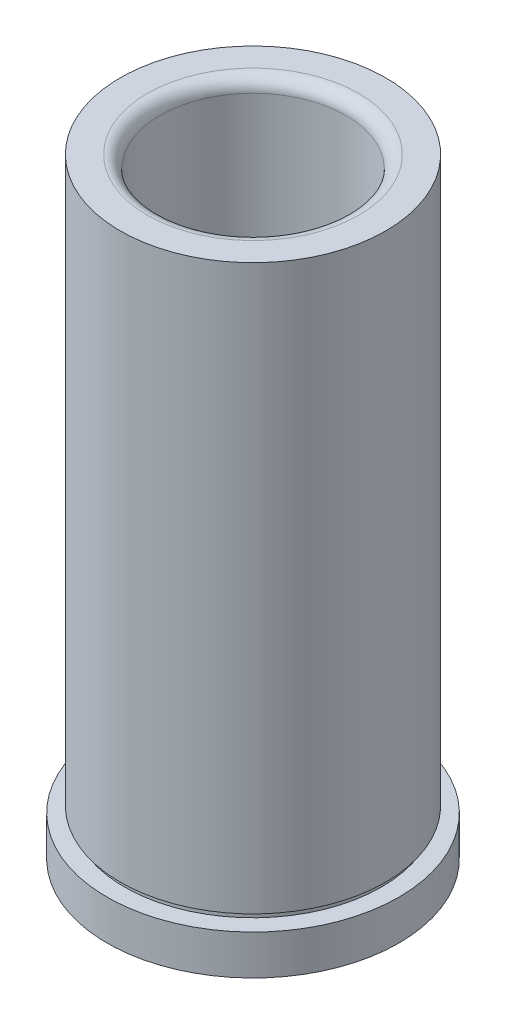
ISO-10303-21;
HEADER;
FILE_DESCRIPTION(('STEP AP214'),'2;1');
FILE_NAME('part.step','',(''),(''),'','','');
FILE_SCHEMA(('AUTOMOTIVE_DESIGN { 1 0 10303 214 1 1 1 1 }'));
ENDSEC;
DATA;
#1=APPLICATION_CONTEXT('core data for automotive mechanical design processes');
#2=APPLICATION_PROTOCOL_DEFINITION('international standard','automotive_design',2000,#1);
#3=PRODUCT_CONTEXT('',#1,'mechanical');
#4=PRODUCT('Part','Part','',(#3));
#5=PRODUCT_RELATED_PRODUCT_CATEGORY('part','',(#4));
#6=PRODUCT_DEFINITION_FORMATION('','',#4);
#7=PRODUCT_DEFINITION_CONTEXT('part definition',#1,'design');
#8=PRODUCT_DEFINITION('design','',#6,#7);
#9=PRODUCT_DEFINITION_SHAPE('','',#8);
#10=(LENGTH_UNIT() NAMED_UNIT(*) SI_UNIT(.MILLI.,.METRE.));
#11=(NAMED_UNIT(*) PLANE_ANGLE_UNIT() SI_UNIT($,.RADIAN.));
#12=(NAMED_UNIT(*) SI_UNIT($,.STERADIAN.) SOLID_ANGLE_UNIT());
#13=UNCERTAINTY_MEASURE_WITH_UNIT(LENGTH_MEASURE(1.E-05),#10,'distance_accuracy_value','');
#14=(GEOMETRIC_REPRESENTATION_CONTEXT(3) GLOBAL_UNCERTAINTY_ASSIGNED_CONTEXT((#13)) GLOBAL_UNIT_ASSIGNED_CONTEXT((#10,
#11,#12)) REPRESENTATION_CONTEXT('',''));
#15=CARTESIAN_POINT('',(0.,0.,0.));
#16=DIRECTION('',(0.,0.,1.));
#17=DIRECTION('',(1.,0.,0.));
#18=AXIS2_PLACEMENT_3D('',#15,#16,#17);
#19=CARTESIAN_POINT('',(-15.88135,73.0249999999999,0.));
#20=DIRECTION('',(0.,-1.,0.));
#21=DIRECTION('',(1.,0.,0.));
#22=AXIS2_PLACEMENT_3D('',#19,#20,#21);
#23=PLANE('',#22);
#24=CARTESIAN_POINT('',(-2.54965572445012E-13,73.025,0.));
#25=DIRECTION('',(0.,-1.,0.));
#26=DIRECTION('',(1.,0.,0.));
#27=AXIS2_PLACEMENT_3D('',#24,#25,#26);
#28=CIRCLE('',#27,12.6428499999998);
#29=CARTESIAN_POINT('',(12.6428499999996,73.025,0.));
#30=VERTEX_POINT('',#29);
#31=EDGE_CURVE('E36',#30,#30,#28,.T.);
#32=ORIENTED_EDGE('',*,*,#31,.T.);
#33=EDGE_LOOP('',(#32));
#34=FACE_BOUND('',#33,.T.);
#35=CARTESIAN_POINT('',(-2.54965572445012E-13,73.0249999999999,0.));
#36=DIRECTION('',(0.,-1.,0.));
#37=DIRECTION('',(1.,0.,0.));
#38=AXIS2_PLACEMENT_3D('',#35,#36,#37);
#39=CIRCLE('',#38,15.8813499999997);
#40=CARTESIAN_POINT('',(15.8813499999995,73.0249999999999,0.));
#41=VERTEX_POINT('',#40);
#42=EDGE_CURVE('E40',#41,#41,#39,.T.);
#43=ORIENTED_EDGE('',*,*,#42,.F.);
#44=EDGE_LOOP('',(#43));
#45=FACE_BOUND('',#44,.T.);
#46=ADVANCED_FACE('F29',(#34,#45),#23,.F.);
#47=CARTESIAN_POINT('',(3.49148336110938E-12,-1000.,0.));
#48=DIRECTION('',(0.,-1.,0.));
#49=DIRECTION('',(1.,0.,0.));
#50=AXIS2_PLACEMENT_3D('',#47,#48,#49);
#51=CYLINDRICAL_SURFACE('',#50,15.8813499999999);
#52=CARTESIAN_POINT('',(0.,5.52449999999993,0.));
#53=DIRECTION('',(0.,-1.,0.));
#54=DIRECTION('',(1.,0.,0.));
#55=AXIS2_PLACEMENT_3D('',#52,#53,#54);
#56=CIRCLE('',#55,15.88135);
#57=CARTESIAN_POINT('',(15.8813499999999,5.52449999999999,0.));
#58=VERTEX_POINT('',#57);
#59=EDGE_CURVE('E44',#58,#58,#56,.T.);
#60=ORIENTED_EDGE('',*,*,#59,.F.);
#61=EDGE_LOOP('',(#60));
#62=FACE_BOUND('',#61,.T.);
#63=ORIENTED_EDGE('',*,*,#42,.T.);
#64=EDGE_LOOP('',(#63));
#65=FACE_BOUND('',#64,.T.);
#66=ADVANCED_FACE('F121',(#62,#65),#51,.T.);
#67=CARTESIAN_POINT('',(-15.88135,5.5244999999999,0.));
#68=DIRECTION('',(0.,1.,0.));
#69=DIRECTION('',(-1.,0.,0.));
#70=AXIS2_PLACEMENT_3D('',#67,#68,#69);
#71=PLANE('',#70);
#72=CARTESIAN_POINT('',(0.,5.52449999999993,0.));
#73=DIRECTION('',(0.,-1.,0.));
#74=DIRECTION('',(1.,0.,0.));
#75=AXIS2_PLACEMENT_3D('',#72,#73,#74);
#76=CIRCLE('',#75,15.37335);
#77=CARTESIAN_POINT('',(15.37335,5.52449999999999,0.));
#78=VERTEX_POINT('',#77);
#79=EDGE_CURVE('E49',#78,#78,#76,.T.);
#80=ORIENTED_EDGE('',*,*,#79,.F.);
#81=EDGE_LOOP('',(#80));
#82=FACE_BOUND('',#81,.T.);
#83=ORIENTED_EDGE('',*,*,#59,.T.);
#84=EDGE_LOOP('',(#83));
#85=FACE_BOUND('',#84,.T.);
#86=ADVANCED_FACE('F115',(#82,#85),#71,.F.);
#87=CARTESIAN_POINT('',(3.49148336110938E-12,-1000.,0.));
#88=DIRECTION('',(0.,-1.,0.));
#89=DIRECTION('',(1.,0.,0.));
#90=AXIS2_PLACEMENT_3D('',#87,#88,#89);
#91=CYLINDRICAL_SURFACE('',#90,15.37335);
#92=CARTESIAN_POINT('',(0.,4.7625,0.));
#93=DIRECTION('',(0.,-1.,0.));
#94=DIRECTION('',(1.,0.,0.));
#95=AXIS2_PLACEMENT_3D('',#92,#93,#94);
#96=CIRCLE('',#95,15.37335);
#97=CARTESIAN_POINT('',(15.37335,4.76250000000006,0.));
#98=VERTEX_POINT('',#97);
#99=EDGE_CURVE('E52',#98,#98,#96,.T.);
#100=ORIENTED_EDGE('',*,*,#99,.F.);
#101=EDGE_LOOP('',(#100));
#102=FACE_BOUND('',#101,.T.);
#103=ORIENTED_EDGE('',*,*,#79,.T.);
#104=EDGE_LOOP('',(#103));
#105=FACE_BOUND('',#104,.T.);
#106=ADVANCED_FACE('F109',(#102,#105),#91,.T.);
#107=CARTESIAN_POINT('',(-17.4625,4.7624999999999,0.));
#108=DIRECTION('',(0.,-1.,0.));
#109=DIRECTION('',(1.,0.,0.));
#110=AXIS2_PLACEMENT_3D('',#107,#108,#109);
#111=PLANE('',#110);
#112=CARTESIAN_POINT('',(0.,4.7625,0.));
#113=DIRECTION('',(0.,-1.,0.));
#114=DIRECTION('',(1.,0.,0.));
#115=AXIS2_PLACEMENT_3D('',#112,#113,#114);
#116=CIRCLE('',#115,17.4625);
#117=CARTESIAN_POINT('',(17.4625,4.76250000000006,0.));
#118=VERTEX_POINT('',#117);
#119=EDGE_CURVE('E55',#118,#118,#116,.T.);
#120=ORIENTED_EDGE('',*,*,#119,.F.);
#121=EDGE_LOOP('',(#120));
#122=FACE_BOUND('',#121,.T.);
#123=ORIENTED_EDGE('',*,*,#99,.T.);
#124=EDGE_LOOP('',(#123));
#125=FACE_BOUND('',#124,.T.);
#126=ADVANCED_FACE('F103',(#122,#125),#111,.F.);
#127=CARTESIAN_POINT('',(3.49148336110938E-12,-1000.,0.));
#128=DIRECTION('',(0.,-1.,0.));
#129=DIRECTION('',(1.,0.,0.));
#130=AXIS2_PLACEMENT_3D('',#127,#128,#129);
#131=CYLINDRICAL_SURFACE('',#130,17.4625);
#132=CARTESIAN_POINT('',(0.,0.,0.));
#133=DIRECTION('',(0.,-1.,0.));
#134=DIRECTION('',(1.,0.,0.));
#135=AXIS2_PLACEMENT_3D('',#132,#133,#134);
#136=CIRCLE('',#135,17.4625);
#137=CARTESIAN_POINT('',(17.4625,0.,0.));
#138=VERTEX_POINT('',#137);
#139=EDGE_CURVE('E58',#138,#138,#136,.T.);
#140=ORIENTED_EDGE('',*,*,#139,.F.);
#141=EDGE_LOOP('',(#140));
#142=FACE_BOUND('',#141,.T.);
#143=ORIENTED_EDGE('',*,*,#119,.T.);
#144=EDGE_LOOP('',(#143));
#145=FACE_BOUND('',#144,.T.);
#146=ADVANCED_FACE('F97',(#142,#145),#131,.T.);
#147=CARTESIAN_POINT('',(-13.1826,0.,0.));
#148=DIRECTION('',(0.,1.,0.));
#149=DIRECTION('',(-1.,0.,0.));
#150=AXIS2_PLACEMENT_3D('',#147,#148,#149);
#151=PLANE('',#150);
#152=CARTESIAN_POINT('',(0.,0.,0.));
#153=DIRECTION('',(0.,-1.,0.));
#154=DIRECTION('',(1.,0.,0.));
#155=AXIS2_PLACEMENT_3D('',#152,#153,#154);
#156=CIRCLE('',#155,13.1826);
#157=CARTESIAN_POINT('',(13.1826,0.,0.));
#158=VERTEX_POINT('',#157);
#159=EDGE_CURVE('E61',#158,#158,#156,.T.);
#160=ORIENTED_EDGE('',*,*,#159,.F.);
#161=EDGE_LOOP('',(#160));
#162=FACE_BOUND('',#161,.T.);
#163=ORIENTED_EDGE('',*,*,#139,.T.);
#164=EDGE_LOOP('',(#163));
#165=FACE_BOUND('',#164,.T.);
#166=ADVANCED_FACE('F91',(#162,#165),#151,.F.);
#167=CARTESIAN_POINT('',(0.,0.,0.));
#168=DIRECTION('',(0.,-1.,0.));
#169=DIRECTION('',(1.,0.,0.));
#170=AXIS2_PLACEMENT_3D('',#167,#168,#169);
#171=CONICAL_SURFACE('',#170,13.1826,0.785398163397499);
#172=CARTESIAN_POINT('',(0.,0.793749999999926,0.));
#173=DIRECTION('',(0.,-1.,0.));
#174=DIRECTION('',(1.,0.,0.));
#175=AXIS2_PLACEMENT_3D('',#172,#173,#174);
#176=CIRCLE('',#175,12.38885);
#177=CARTESIAN_POINT('',(12.38885,0.79374999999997,0.));
#178=VERTEX_POINT('',#177);
#179=EDGE_CURVE('E64',#178,#178,#176,.T.);
#180=ORIENTED_EDGE('',*,*,#179,.F.);
#181=EDGE_LOOP('',(#180));
#182=FACE_BOUND('',#181,.T.);
#183=ORIENTED_EDGE('',*,*,#159,.T.);
#184=EDGE_LOOP('',(#183));
#185=FACE_BOUND('',#184,.T.);
#186=ADVANCED_FACE('F85',(#182,#185),#171,.F.);
#187=CARTESIAN_POINT('',(3.49148336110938E-12,-1000.,0.));
#188=DIRECTION('',(0.,-1.,0.));
#189=DIRECTION('',(1.,0.,0.));
#190=AXIS2_PLACEMENT_3D('',#187,#188,#189);
#191=CYLINDRICAL_SURFACE('',#190,12.3888499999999);
#192=CARTESIAN_POINT('',(0.,27.3049999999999,0.));
#193=DIRECTION('',(0.,-1.,0.));
#194=DIRECTION('',(1.,0.,0.));
#195=AXIS2_PLACEMENT_3D('',#192,#193,#194);
#196=CIRCLE('',#195,12.3888499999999);
#197=CARTESIAN_POINT('',(12.3888499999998,27.305,0.));
#198=VERTEX_POINT('',#197);
#199=EDGE_CURVE('E67',#198,#198,#196,.T.);
#200=ORIENTED_EDGE('',*,*,#199,.F.);
#201=EDGE_LOOP('',(#200));
#202=FACE_BOUND('',#201,.T.);
#203=ORIENTED_EDGE('',*,*,#179,.T.);
#204=EDGE_LOOP('',(#203));
#205=FACE_BOUND('',#204,.T.);
#206=ADVANCED_FACE('F79',(#202,#205),#191,.F.);
#207=CARTESIAN_POINT('',(0.,27.3049999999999,0.));
#208=DIRECTION('',(0.,-1.,0.));
#209=DIRECTION('',(1.,0.,0.));
#210=AXIS2_PLACEMENT_3D('',#207,#208,#209);
#211=TOROIDAL_SURFACE('',#210,11.1188499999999,1.27);
#212=CARTESIAN_POINT('',(0.,28.575,0.));
#213=DIRECTION('',(0.,-1.,0.));
#214=DIRECTION('',(1.,0.,0.));
#215=AXIS2_PLACEMENT_3D('',#212,#213,#214);
#216=CIRCLE('',#215,11.1188499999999);
#217=CARTESIAN_POINT('',(11.1188499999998,28.5750000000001,0.));
#218=VERTEX_POINT('',#217);
#219=EDGE_CURVE('E70',#218,#218,#216,.T.);
#220=ORIENTED_EDGE('',*,*,#219,.F.);
#221=EDGE_LOOP('',(#220));
#222=FACE_BOUND('',#221,.T.);
#223=ORIENTED_EDGE('',*,*,#199,.T.);
#224=EDGE_LOOP('',(#223));
#225=FACE_BOUND('',#224,.T.);
#226=ADVANCED_FACE('F76',(#222,#225),#211,.F.);
#227=CARTESIAN_POINT('',(3.49148336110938E-12,-1000.,0.));
#228=DIRECTION('',(0.,-1.,0.));
#229=DIRECTION('',(1.,0.,0.));
#230=AXIS2_PLACEMENT_3D('',#227,#228,#229);
#231=CYLINDRICAL_SURFACE('',#230,11.1188499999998);
#232=CARTESIAN_POINT('',(-2.49644551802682E-13,71.501,0.));
#233=DIRECTION('',(0.,-1.,0.));
#234=DIRECTION('',(1.,0.,0.));
#235=AXIS2_PLACEMENT_3D('',#232,#233,#234);
#236=CIRCLE('',#235,11.1188499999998);
#237=CARTESIAN_POINT('',(11.1188499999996,71.5010000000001,0.));
#238=VERTEX_POINT('',#237);
#239=EDGE_CURVE('E10',#238,#238,#236,.F.);
#240=ORIENTED_EDGE('',*,*,#239,.T.);
#241=EDGE_LOOP('',(#240));
#242=FACE_BOUND('',#241,.T.);
#243=ORIENTED_EDGE('',*,*,#219,.T.);
#244=EDGE_LOOP('',(#243));
#245=FACE_BOUND('',#244,.T.);
#246=ADVANCED_FACE('F74',(#242,#245),#231,.F.);
#247=CARTESIAN_POINT('',(-2.49644551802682E-13,71.501,0.));
#248=DIRECTION('',(0.,-1.,0.));
#249=DIRECTION('',(1.,0.,0.));
#250=AXIS2_PLACEMENT_3D('',#247,#248,#249);
#251=TOROIDAL_SURFACE('',#250,12.6428499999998,1.524);
#252=ORIENTED_EDGE('',*,*,#239,.F.);
#253=EDGE_LOOP('',(#252));
#254=FACE_BOUND('',#253,.T.);
#255=ORIENTED_EDGE('',*,*,#31,.F.);
#256=EDGE_LOOP('',(#255));
#257=FACE_BOUND('',#256,.T.);
#258=ADVANCED_FACE('F31',(#254,#257),#251,.T.);
#259=CLOSED_SHELL('',(#46,#66,#86,#106,#126,#146,#166,#186,#206,#226,#246,#258));
#260=MANIFOLD_SOLID_BREP('B2',#259);
#261=ADVANCED_BREP_SHAPE_REPRESENTATION('',(#18,#260),#14);
#262=SHAPE_DEFINITION_REPRESENTATION(#9,#261);
ENDSEC;
END-ISO-10303-21;
